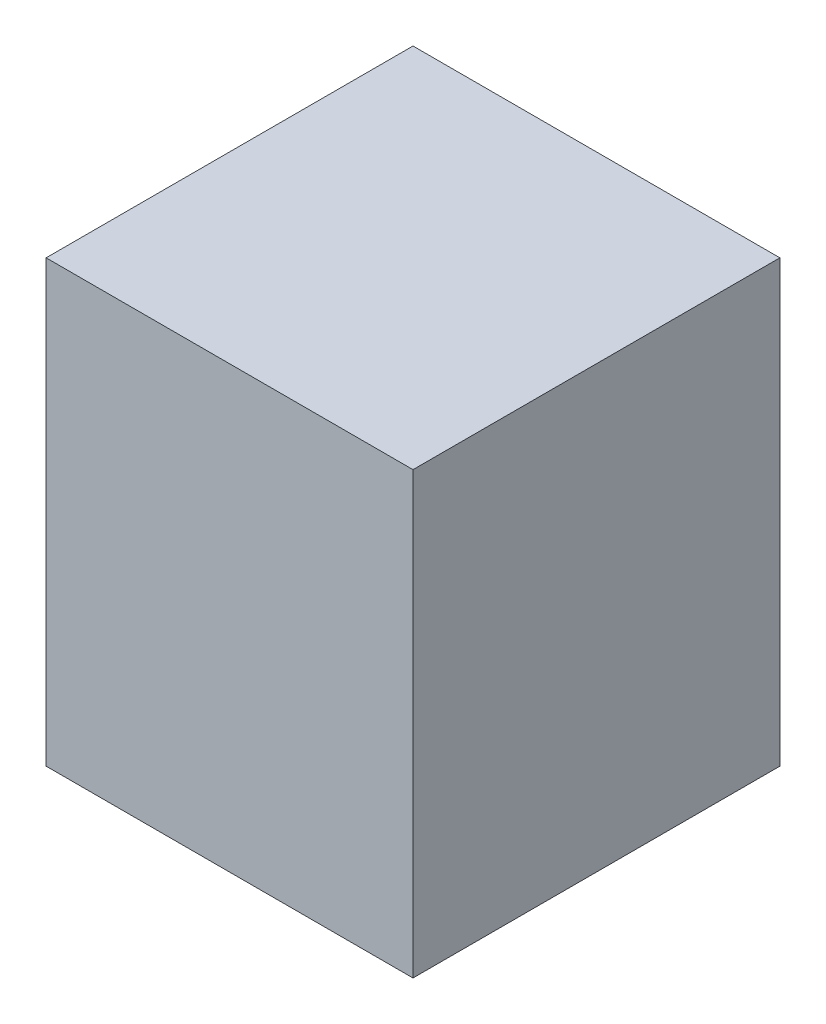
from build123d import *

# Parameters (mm, degrees)
SKETCH1_W           = 50
SKETCH1_H           = 50
BOSS_EXTRUDE1_DEPTH = 60


with BuildPart() as part:
    # Sketch1 → Boss-Extrude1 (new body)
    with BuildSketch(Plane(origin=(0, 0, 0), x_dir=(1, 0, 0), z_dir=(0, 1, 0))):
        Rectangle(SKETCH1_W, SKETCH1_H)
    extrude(amount=BOSS_EXTRUDE1_DEPTH)


solid = part.part
